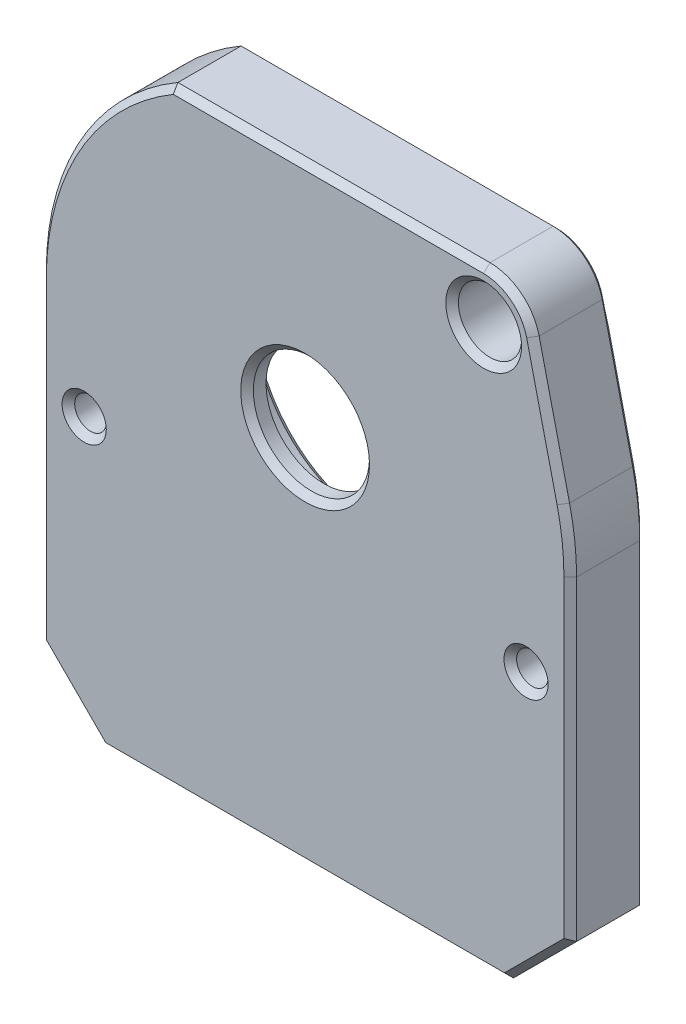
ISO-10303-21;
HEADER;
FILE_DESCRIPTION(('STEP AP214'),'2;1');
FILE_NAME('part.step','',(''),(''),'','','');
FILE_SCHEMA(('AUTOMOTIVE_DESIGN { 1 0 10303 214 1 1 1 1 }'));
ENDSEC;
DATA;
#1=APPLICATION_CONTEXT('core data for automotive mechanical design processes');
#2=APPLICATION_PROTOCOL_DEFINITION('international standard','automotive_design',2000,#1);
#3=PRODUCT_CONTEXT('',#1,'mechanical');
#4=PRODUCT('Part','Part','',(#3));
#5=PRODUCT_RELATED_PRODUCT_CATEGORY('part','',(#4));
#6=PRODUCT_DEFINITION_FORMATION('','',#4);
#7=PRODUCT_DEFINITION_CONTEXT('part definition',#1,'design');
#8=PRODUCT_DEFINITION('design','',#6,#7);
#9=PRODUCT_DEFINITION_SHAPE('','',#8);
#10=(LENGTH_UNIT() NAMED_UNIT(*) SI_UNIT(.MILLI.,.METRE.));
#11=(NAMED_UNIT(*) PLANE_ANGLE_UNIT() SI_UNIT($,.RADIAN.));
#12=(NAMED_UNIT(*) SI_UNIT($,.STERADIAN.) SOLID_ANGLE_UNIT());
#13=UNCERTAINTY_MEASURE_WITH_UNIT(LENGTH_MEASURE(1.E-05),#10,'distance_accuracy_value','');
#14=(GEOMETRIC_REPRESENTATION_CONTEXT(3) GLOBAL_UNCERTAINTY_ASSIGNED_CONTEXT((#13)) GLOBAL_UNIT_ASSIGNED_CONTEXT((#10,
#11,#12)) REPRESENTATION_CONTEXT('',''));
#15=CARTESIAN_POINT('',(0.,0.,0.));
#16=DIRECTION('',(0.,0.,1.));
#17=DIRECTION('',(1.,0.,0.));
#18=AXIS2_PLACEMENT_3D('',#15,#16,#17);
#19=CARTESIAN_POINT('',(14.1421356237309,14.142135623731,6.));
#20=DIRECTION('',(0.,0.,-1.));
#21=DIRECTION('',(-1.,0.,0.));
#22=AXIS2_PLACEMENT_3D('',#19,#20,#21);
#23=CYLINDRICAL_SURFACE('',#22,2.5);
#24=CARTESIAN_POINT('',(14.1421356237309,14.142135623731,5.50000000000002));
#25=DIRECTION('',(0.,0.,1.));
#26=DIRECTION('',(1.,0.,0.));
#27=AXIS2_PLACEMENT_3D('',#24,#25,#26);
#28=CIRCLE('',#27,2.5);
#29=CARTESIAN_POINT('',(16.6421356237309,14.142135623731,5.50000000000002));
#30=VERTEX_POINT('',#29);
#31=EDGE_CURVE('E233',#30,#30,#28,.T.);
#32=ORIENTED_EDGE('',*,*,#31,.T.);
#33=EDGE_LOOP('',(#32));
#34=FACE_BOUND('',#33,.T.);
#35=CARTESIAN_POINT('',(14.1421356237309,14.142135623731,1.50000000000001));
#36=DIRECTION('',(0.,0.,-1.));
#37=DIRECTION('',(-1.,0.,0.));
#38=AXIS2_PLACEMENT_3D('',#35,#36,#37);
#39=CIRCLE('',#38,2.5);
#40=CARTESIAN_POINT('',(11.6421356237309,14.142135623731,1.50000000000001));
#41=VERTEX_POINT('',#40);
#42=EDGE_CURVE('E230',#41,#41,#39,.T.);
#43=ORIENTED_EDGE('',*,*,#42,.T.);
#44=EDGE_LOOP('',(#43));
#45=FACE_BOUND('',#44,.T.);
#46=ADVANCED_FACE('F37',(#34,#45),#23,.F.);
#47=CARTESIAN_POINT('',(0.,0.,6.));
#48=DIRECTION('',(0.,0.,-1.));
#49=DIRECTION('',(-1.,0.,0.));
#50=AXIS2_PLACEMENT_3D('',#47,#48,#49);
#51=CYLINDRICAL_SURFACE('',#50,4.6);
#52=CARTESIAN_POINT('',(0.,0.,5.49999999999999));
#53=DIRECTION('',(0.,0.,1.));
#54=DIRECTION('',(1.,0.,0.));
#55=AXIS2_PLACEMENT_3D('',#52,#53,#54);
#56=CIRCLE('',#55,4.6);
#57=CARTESIAN_POINT('',(4.6,0.,5.49999999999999));
#58=VERTEX_POINT('',#57);
#59=EDGE_CURVE('E47',#58,#58,#56,.T.);
#60=ORIENTED_EDGE('',*,*,#59,.T.);
#61=EDGE_LOOP('',(#60));
#62=FACE_BOUND('',#61,.T.);
#63=CARTESIAN_POINT('',(0.,0.,4.5));
#64=DIRECTION('',(0.,0.,-1.));
#65=DIRECTION('',(-1.,0.,0.));
#66=AXIS2_PLACEMENT_3D('',#63,#64,#65);
#67=CIRCLE('',#66,4.6);
#68=CARTESIAN_POINT('',(-4.6,0.,4.5));
#69=VERTEX_POINT('',#68);
#70=EDGE_CURVE('E462',#69,#69,#67,.T.);
#71=ORIENTED_EDGE('',*,*,#70,.T.);
#72=EDGE_LOOP('',(#71));
#73=FACE_BOUND('',#72,.T.);
#74=ADVANCED_FACE('F613',(#62,#73),#51,.F.);
#75=CARTESIAN_POINT('',(0.,0.,6.));
#76=DIRECTION('',(0.,0.,1.));
#77=DIRECTION('',(1.,0.,0.));
#78=AXIS2_PLACEMENT_3D('',#75,#76,#77);
#79=PLANE('',#78);
#80=CARTESIAN_POINT('',(17.5,-8.,6.));
#81=DIRECTION('',(0.,0.,1.));
#82=DIRECTION('',(1.,0.,0.));
#83=AXIS2_PLACEMENT_3D('',#80,#81,#82);
#84=CIRCLE('',#83,1.75000000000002);
#85=CARTESIAN_POINT('',(19.25,-8.,6.));
#86=VERTEX_POINT('',#85);
#87=EDGE_CURVE('E227',#86,#86,#84,.F.);
#88=ORIENTED_EDGE('',*,*,#87,.T.);
#89=EDGE_LOOP('',(#88));
#90=FACE_BOUND('',#89,.T.);
#91=CARTESIAN_POINT('',(14.1421356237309,14.142135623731,6.));
#92=DIRECTION('',(0.,0.,1.));
#93=DIRECTION('',(1.,0.,0.));
#94=AXIS2_PLACEMENT_3D('',#91,#92,#93);
#95=CIRCLE('',#94,2.99999999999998);
#96=CARTESIAN_POINT('',(17.1421356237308,14.142135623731,6.));
#97=VERTEX_POINT('',#96);
#98=EDGE_CURVE('E224',#97,#97,#95,.F.);
#99=ORIENTED_EDGE('',*,*,#98,.T.);
#100=EDGE_LOOP('',(#99));
#101=FACE_BOUND('',#100,.T.);
#102=CARTESIAN_POINT('',(14.1421356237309,14.142135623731,6.));
#103=DIRECTION('',(0.,0.,1.));
#104=DIRECTION('',(1.,0.,0.));
#105=AXIS2_PLACEMENT_3D('',#102,#103,#104);
#106=CIRCLE('',#105,3.49999999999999);
#107=CARTESIAN_POINT('',(17.5494989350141,14.9420576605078,6.));
#108=VERTEX_POINT('',#107);
#109=CARTESIAN_POINT('',(14.1421356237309,17.642135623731,6.));
#110=VERTEX_POINT('',#109);
#111=EDGE_CURVE('E56',#108,#110,#106,.T.);
#112=ORIENTED_EDGE('',*,*,#111,.T.);
#113=DIRECTION('',(-1.,0.,0.));
#114=VECTOR('',#113,1.);
#115=CARTESIAN_POINT('',(-10.5765266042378,17.642135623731,6.));
#116=LINE('',#115,#114);
#117=CARTESIAN_POINT('',(-10.440548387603,17.642135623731,6.));
#118=VERTEX_POINT('',#117);
#119=EDGE_CURVE('E219',#110,#118,#116,.T.);
#120=ORIENTED_EDGE('',*,*,#119,.T.);
#121=CARTESIAN_POINT('',(0.,0.,6.));
#122=DIRECTION('',(0.,0.,1.));
#123=DIRECTION('',(1.,0.,0.));
#124=AXIS2_PLACEMENT_3D('',#121,#122,#123);
#125=CIRCLE('',#124,20.5);
#126=CARTESIAN_POINT('',(-20.5,0.,6.));
#127=VERTEX_POINT('',#126);
#128=EDGE_CURVE('E414',#118,#127,#125,.T.);
#129=ORIENTED_EDGE('',*,*,#128,.T.);
#130=DIRECTION('',(0.,-1.,0.));
#131=VECTOR('',#130,1.);
#132=CARTESIAN_POINT('',(-20.5,-25.,6.));
#133=LINE('',#132,#131);
#134=CARTESIAN_POINT('',(-20.5,-24.7928932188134,6.));
#135=VERTEX_POINT('',#134);
#136=EDGE_CURVE('E416',#127,#135,#133,.T.);
#137=ORIENTED_EDGE('',*,*,#136,.T.);
#138=DIRECTION('',(0.707106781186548,-0.707106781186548,0.));
#139=VECTOR('',#138,1.);
#140=CARTESIAN_POINT('',(-15.6464466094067,-29.6464466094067,6.));
#141=LINE('',#140,#139);
#142=CARTESIAN_POINT('',(-15.7928932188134,-29.5,6.));
#143=VERTEX_POINT('',#142);
#144=EDGE_CURVE('E418',#135,#143,#141,.T.);
#145=ORIENTED_EDGE('',*,*,#144,.T.);
#146=DIRECTION('',(1.,0.,0.));
#147=VECTOR('',#146,1.);
#148=CARTESIAN_POINT('',(16.,-29.5,6.));
#149=LINE('',#148,#147);
#150=CARTESIAN_POINT('',(15.7928932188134,-29.5,6.));
#151=VERTEX_POINT('',#150);
#152=EDGE_CURVE('E420',#143,#151,#149,.T.);
#153=ORIENTED_EDGE('',*,*,#152,.T.);
#154=DIRECTION('',(0.707106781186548,0.707106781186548,0.));
#155=VECTOR('',#154,1.);
#156=CARTESIAN_POINT('',(20.6464466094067,-24.6464466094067,6.));
#157=LINE('',#156,#155);
#158=CARTESIAN_POINT('',(20.5,-24.7928932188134,6.));
#159=VERTEX_POINT('',#158);
#160=EDGE_CURVE('E365',#151,#159,#157,.T.);
#161=ORIENTED_EDGE('',*,*,#160,.T.);
#162=DIRECTION('',(0.,1.,0.));
#163=VECTOR('',#162,1.);
#164=CARTESIAN_POINT('',(20.5,0.,6.));
#165=LINE('',#164,#163);
#166=CARTESIAN_POINT('',(20.5,0.,6.));
#167=VERTEX_POINT('',#166);
#168=EDGE_CURVE('E200',#159,#167,#165,.T.);
#169=ORIENTED_EDGE('',*,*,#168,.T.);
#170=CARTESIAN_POINT('',(0.,0.,6.));
#171=DIRECTION('',(0.,0.,1.));
#172=DIRECTION('',(1.,0.,0.));
#173=AXIS2_PLACEMENT_3D('',#170,#171,#172);
#174=CIRCLE('',#173,20.5);
#175=CARTESIAN_POINT('',(19.9574136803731,4.68525764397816,6.));
#176=VERTEX_POINT('',#175);
#177=EDGE_CURVE('E192',#167,#176,#174,.T.);
#178=ORIENTED_EDGE('',*,*,#177,.T.);
#179=DIRECTION('',(-0.228549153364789,0.973532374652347,0.));
#180=VECTOR('',#179,1.);
#181=CARTESIAN_POINT('',(17.5494989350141,14.9420576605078,6.));
#182=LINE('',#181,#180);
#183=EDGE_CURVE('E197',#176,#108,#182,.T.);
#184=ORIENTED_EDGE('',*,*,#183,.T.);
#185=EDGE_LOOP('',(#112,#120,#129,#137,#145,#153,#161,#169,#178,#184));
#186=FACE_BOUND('',#185,.T.);
#187=CARTESIAN_POINT('',(0.,0.,6.));
#188=DIRECTION('',(0.,0.,1.));
#189=DIRECTION('',(1.,0.,0.));
#190=AXIS2_PLACEMENT_3D('',#187,#188,#189);
#191=CIRCLE('',#190,5.10000000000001);
#192=CARTESIAN_POINT('',(5.10000000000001,0.,6.));
#193=VERTEX_POINT('',#192);
#194=EDGE_CURVE('E411',#193,#193,#191,.F.);
#195=ORIENTED_EDGE('',*,*,#194,.T.);
#196=EDGE_LOOP('',(#195));
#197=FACE_BOUND('',#196,.T.);
#198=CARTESIAN_POINT('',(-17.5,-8.,6.));
#199=DIRECTION('',(0.,0.,1.));
#200=DIRECTION('',(1.,0.,0.));
#201=AXIS2_PLACEMENT_3D('',#198,#199,#200);
#202=CIRCLE('',#201,1.75000000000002);
#203=CARTESIAN_POINT('',(-15.75,-8.,6.));
#204=VERTEX_POINT('',#203);
#205=EDGE_CURVE('E408',#204,#204,#202,.F.);
#206=ORIENTED_EDGE('',*,*,#205,.T.);
#207=EDGE_LOOP('',(#206));
#208=FACE_BOUND('',#207,.T.);
#209=ADVANCED_FACE('F194',(#90,#101,#186,#197,#208),#79,.T.);
#210=CARTESIAN_POINT('',(0.,0.,0.));
#211=DIRECTION('',(0.,0.,1.));
#212=DIRECTION('',(1.,0.,0.));
#213=AXIS2_PLACEMENT_3D('',#210,#211,#212);
#214=PLANE('',#213);
#215=CARTESIAN_POINT('',(17.5,-8.,0.));
#216=DIRECTION('',(0.,0.,1.));
#217=DIRECTION('',(1.,0.,0.));
#218=AXIS2_PLACEMENT_3D('',#215,#216,#217);
#219=CIRCLE('',#218,1.75000000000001);
#220=CARTESIAN_POINT('',(19.25,-8.,0.));
#221=VERTEX_POINT('',#220);
#222=EDGE_CURVE('E492',#221,#221,#219,.T.);
#223=ORIENTED_EDGE('',*,*,#222,.T.);
#224=EDGE_LOOP('',(#223));
#225=FACE_BOUND('',#224,.T.);
#226=CARTESIAN_POINT('',(-17.5,-8.,0.));
#227=DIRECTION('',(0.,0.,1.));
#228=DIRECTION('',(1.,0.,0.));
#229=AXIS2_PLACEMENT_3D('',#226,#227,#228);
#230=CIRCLE('',#229,1.75000000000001);
#231=CARTESIAN_POINT('',(-15.75,-8.,0.));
#232=VERTEX_POINT('',#231);
#233=EDGE_CURVE('E489',#232,#232,#230,.T.);
#234=ORIENTED_EDGE('',*,*,#233,.T.);
#235=EDGE_LOOP('',(#234));
#236=FACE_BOUND('',#235,.T.);
#237=CARTESIAN_POINT('',(0.,0.,0.));
#238=DIRECTION('',(0.,0.,1.));
#239=DIRECTION('',(1.,0.,0.));
#240=AXIS2_PLACEMENT_3D('',#237,#238,#239);
#241=CIRCLE('',#240,10.);
#242=CARTESIAN_POINT('',(10.,0.,0.));
#243=VERTEX_POINT('',#242);
#244=EDGE_CURVE('E486',#243,#243,#241,.T.);
#245=ORIENTED_EDGE('',*,*,#244,.T.);
#246=EDGE_LOOP('',(#245));
#247=FACE_BOUND('',#246,.T.);
#248=DIRECTION('',(0.,1.,0.));
#249=VECTOR('',#248,1.);
#250=CARTESIAN_POINT('',(-20.5,0.,0.));
#251=LINE('',#250,#249);
#252=CARTESIAN_POINT('',(-20.5,-24.7928932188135,0.));
#253=VERTEX_POINT('',#252);
#254=CARTESIAN_POINT('',(-20.5,0.,0.));
#255=VERTEX_POINT('',#254);
#256=EDGE_CURVE('E481',#253,#255,#251,.T.);
#257=ORIENTED_EDGE('',*,*,#256,.T.);
#258=CARTESIAN_POINT('',(0.,0.,0.));
#259=DIRECTION('',(0.,0.,1.));
#260=DIRECTION('',(1.,0.,0.));
#261=AXIS2_PLACEMENT_3D('',#258,#259,#260);
#262=CIRCLE('',#261,20.5);
#263=CARTESIAN_POINT('',(-10.440548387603,17.642135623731,0.));
#264=VERTEX_POINT('',#263);
#265=EDGE_CURVE('E484',#255,#264,#262,.F.);
#266=ORIENTED_EDGE('',*,*,#265,.T.);
#267=DIRECTION('',(1.,0.,0.));
#268=VECTOR('',#267,1.);
#269=CARTESIAN_POINT('',(0.,17.642135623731,0.));
#270=LINE('',#269,#268);
#271=CARTESIAN_POINT('',(12.2056439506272,17.642135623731,0.));
#272=VERTEX_POINT('',#271);
#273=EDGE_CURVE('E83',#264,#272,#270,.T.);
#274=ORIENTED_EDGE('',*,*,#273,.T.);
#275=CARTESIAN_POINT('',(14.1421356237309,14.142135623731,0.));
#276=DIRECTION('',(0.,0.,1.));
#277=DIRECTION('',(1.,0.,0.));
#278=AXIS2_PLACEMENT_3D('',#275,#276,#277);
#279=CIRCLE('',#278,4.);
#280=CARTESIAN_POINT('',(17.9920824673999,13.0568203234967,0.));
#281=VERTEX_POINT('',#280);
#282=EDGE_CURVE('E461',#272,#281,#279,.T.);
#283=ORIENTED_EDGE('',*,*,#282,.T.);
#284=DIRECTION('',(0.228549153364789,-0.973532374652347,0.));
#285=VECTOR('',#284,1.);
#286=CARTESIAN_POINT('',(19.9574136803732,4.68525764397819,0.));
#287=LINE('',#286,#285);
#288=CARTESIAN_POINT('',(19.9574136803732,4.68525764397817,0.));
#289=VERTEX_POINT('',#288);
#290=EDGE_CURVE('E469',#281,#289,#287,.T.);
#291=ORIENTED_EDGE('',*,*,#290,.T.);
#292=CARTESIAN_POINT('',(0.,0.,0.));
#293=DIRECTION('',(0.,0.,1.));
#294=DIRECTION('',(1.,0.,0.));
#295=AXIS2_PLACEMENT_3D('',#292,#293,#294);
#296=CIRCLE('',#295,20.5);
#297=CARTESIAN_POINT('',(20.5,0.,0.));
#298=VERTEX_POINT('',#297);
#299=EDGE_CURVE('E471',#289,#298,#296,.F.);
#300=ORIENTED_EDGE('',*,*,#299,.T.);
#301=DIRECTION('',(0.,-1.,0.));
#302=VECTOR('',#301,1.);
#303=CARTESIAN_POINT('',(20.5,0.,0.));
#304=LINE('',#303,#302);
#305=CARTESIAN_POINT('',(20.5,-24.7928932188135,0.));
#306=VERTEX_POINT('',#305);
#307=EDGE_CURVE('E473',#298,#306,#304,.T.);
#308=ORIENTED_EDGE('',*,*,#307,.T.);
#309=DIRECTION('',(-0.707106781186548,-0.707106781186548,0.));
#310=VECTOR('',#309,1.);
#311=CARTESIAN_POINT('',(22.6464466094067,-22.6464466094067,0.));
#312=LINE('',#311,#310);
#313=CARTESIAN_POINT('',(15.7928932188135,-29.5,0.));
#314=VERTEX_POINT('',#313);
#315=EDGE_CURVE('E475',#306,#314,#312,.T.);
#316=ORIENTED_EDGE('',*,*,#315,.T.);
#317=DIRECTION('',(-1.,0.,0.));
#318=VECTOR('',#317,1.);
#319=CARTESIAN_POINT('',(0.,-29.5,0.));
#320=LINE('',#319,#318);
#321=CARTESIAN_POINT('',(-15.7928932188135,-29.5,0.));
#322=VERTEX_POINT('',#321);
#323=EDGE_CURVE('E477',#314,#322,#320,.T.);
#324=ORIENTED_EDGE('',*,*,#323,.T.);
#325=DIRECTION('',(-0.707106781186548,0.707106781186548,0.));
#326=VECTOR('',#325,1.);
#327=CARTESIAN_POINT('',(-22.6464466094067,-22.6464466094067,0.));
#328=LINE('',#327,#326);
#329=EDGE_CURVE('E479',#322,#253,#328,.T.);
#330=ORIENTED_EDGE('',*,*,#329,.T.);
#331=EDGE_LOOP('',(#257,#266,#274,#283,#291,#300,#308,#316,#324,#330));
#332=FACE_BOUND('',#331,.T.);
#333=ADVANCED_FACE('F563',(#225,#236,#247,#332),#214,.F.);
#334=CARTESIAN_POINT('',(0.,0.,6.));
#335=DIRECTION('',(0.,0.,-1.));
#336=DIRECTION('',(-1.,0.,0.));
#337=AXIS2_PLACEMENT_3D('',#334,#335,#336);
#338=CYLINDRICAL_SURFACE('',#337,21.);
#339=DIRECTION('',(0.,0.,-1.));
#340=VECTOR('',#339,1.);
#341=CARTESIAN_POINT('',(-10.5765266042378,18.142135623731,6.));
#342=LINE('',#341,#340);
#343=CARTESIAN_POINT('',(-10.5765266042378,18.142135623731,5.49999999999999));
#344=VERTEX_POINT('',#343);
#345=CARTESIAN_POINT('',(-10.5765266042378,18.142135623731,0.49999999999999));
#346=VERTEX_POINT('',#345);
#347=EDGE_CURVE('E531',#344,#346,#342,.T.);
#348=ORIENTED_EDGE('',*,*,#347,.T.);
#349=CARTESIAN_POINT('',(0.,0.,0.49999999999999));
#350=DIRECTION('',(0.,0.,1.));
#351=DIRECTION('',(1.,0.,0.));
#352=AXIS2_PLACEMENT_3D('',#349,#350,#351);
#353=CIRCLE('',#352,21.);
#354=CARTESIAN_POINT('',(-21.,0.,0.49999999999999));
#355=VERTEX_POINT('',#354);
#356=EDGE_CURVE('E400',#346,#355,#353,.T.);
#357=ORIENTED_EDGE('',*,*,#356,.T.);
#358=DIRECTION('',(0.,0.,-1.));
#359=VECTOR('',#358,1.);
#360=CARTESIAN_POINT('',(-21.,0.,6.));
#361=LINE('',#360,#359);
#362=CARTESIAN_POINT('',(-21.,0.,5.49999999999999));
#363=VERTEX_POINT('',#362);
#364=EDGE_CURVE('E453',#363,#355,#361,.T.);
#365=ORIENTED_EDGE('',*,*,#364,.F.);
#366=CARTESIAN_POINT('',(0.,0.,5.49999999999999));
#367=DIRECTION('',(0.,0.,1.));
#368=DIRECTION('',(1.,0.,0.));
#369=AXIS2_PLACEMENT_3D('',#366,#367,#368);
#370=CIRCLE('',#369,21.);
#371=EDGE_CURVE('E398',#363,#344,#370,.F.);
#372=ORIENTED_EDGE('',*,*,#371,.T.);
#373=EDGE_LOOP('',(#348,#357,#365,#372));
#374=FACE_BOUND('',#373,.T.);
#375=ADVANCED_FACE('F514',(#374),#338,.T.);
#376=CARTESIAN_POINT('',(-21.,0.,6.));
#377=DIRECTION('',(1.,0.,0.));
#378=DIRECTION('',(0.,0.,-1.));
#379=AXIS2_PLACEMENT_3D('',#376,#377,#378);
#380=PLANE('',#379);
#381=ORIENTED_EDGE('',*,*,#364,.T.);
#382=DIRECTION('',(0.,-1.,0.));
#383=VECTOR('',#382,1.);
#384=CARTESIAN_POINT('',(-21.,0.,0.49999999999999));
#385=LINE('',#384,#383);
#386=CARTESIAN_POINT('',(-21.,-25.,0.49999999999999));
#387=VERTEX_POINT('',#386);
#388=EDGE_CURVE('E436',#355,#387,#385,.T.);
#389=ORIENTED_EDGE('',*,*,#388,.T.);
#390=DIRECTION('',(0.,0.,-1.));
#391=VECTOR('',#390,1.);
#392=CARTESIAN_POINT('',(-21.,-25.,6.));
#393=LINE('',#392,#391);
#394=CARTESIAN_POINT('',(-21.,-25.,5.49999999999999));
#395=VERTEX_POINT('',#394);
#396=EDGE_CURVE('E451',#395,#387,#393,.T.);
#397=ORIENTED_EDGE('',*,*,#396,.F.);
#398=DIRECTION('',(0.,1.,0.));
#399=VECTOR('',#398,1.);
#400=CARTESIAN_POINT('',(-21.,0.,5.49999999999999));
#401=LINE('',#400,#399);
#402=EDGE_CURVE('E440',#395,#363,#401,.T.);
#403=ORIENTED_EDGE('',*,*,#402,.T.);
#404=EDGE_LOOP('',(#381,#389,#397,#403));
#405=FACE_BOUND('',#404,.T.);
#406=ADVANCED_FACE('F508',(#405),#380,.F.);
#407=CARTESIAN_POINT('',(-21.,-25.,6.));
#408=DIRECTION('',(0.707106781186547,0.707106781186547,0.));
#409=DIRECTION('',(-0.707106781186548,0.707106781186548,0.));
#410=AXIS2_PLACEMENT_3D('',#407,#408,#409);
#411=PLANE('',#410);
#412=ORIENTED_EDGE('',*,*,#396,.T.);
#413=DIRECTION('',(0.707106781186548,-0.707106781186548,0.));
#414=VECTOR('',#413,1.);
#415=CARTESIAN_POINT('',(-21.,-25.,0.49999999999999));
#416=LINE('',#415,#414);
#417=CARTESIAN_POINT('',(-16.,-30.,0.49999999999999));
#418=VERTEX_POINT('',#417);
#419=EDGE_CURVE('E435',#387,#418,#416,.T.);
#420=ORIENTED_EDGE('',*,*,#419,.T.);
#421=DIRECTION('',(0.,0.,-1.));
#422=VECTOR('',#421,1.);
#423=CARTESIAN_POINT('',(-16.,-30.,6.));
#424=LINE('',#423,#422);
#425=CARTESIAN_POINT('',(-16.,-30.,5.49999999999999));
#426=VERTEX_POINT('',#425);
#427=EDGE_CURVE('E446',#426,#418,#424,.T.);
#428=ORIENTED_EDGE('',*,*,#427,.F.);
#429=DIRECTION('',(-0.707106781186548,0.707106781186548,0.));
#430=VECTOR('',#429,1.);
#431=CARTESIAN_POINT('',(-21.,-25.,5.49999999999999));
#432=LINE('',#431,#430);
#433=EDGE_CURVE('E429',#426,#395,#432,.T.);
#434=ORIENTED_EDGE('',*,*,#433,.T.);
#435=EDGE_LOOP('',(#412,#420,#428,#434));
#436=FACE_BOUND('',#435,.T.);
#437=ADVANCED_FACE('F449',(#436),#411,.F.);
#438=CARTESIAN_POINT('',(-16.,-30.,6.));
#439=DIRECTION('',(0.,1.,0.));
#440=DIRECTION('',(0.,0.,1.));
#441=AXIS2_PLACEMENT_3D('',#438,#439,#440);
#442=PLANE('',#441);
#443=CARTESIAN_POINT('',(-10.,-30.,3.));
#444=DIRECTION('',(0.,-1.,0.));
#445=DIRECTION('',(0.,0.,-1.));
#446=AXIS2_PLACEMENT_3D('',#443,#444,#445);
#447=CIRCLE('',#446,1.25);
#448=CARTESIAN_POINT('',(-10.,-30.,1.75));
#449=VERTEX_POINT('',#448);
#450=EDGE_CURVE('E584',#449,#449,#447,.T.);
#451=ORIENTED_EDGE('',*,*,#450,.F.);
#452=EDGE_LOOP('',(#451));
#453=FACE_BOUND('',#452,.T.);
#454=CARTESIAN_POINT('',(10.,-30.,3.));
#455=DIRECTION('',(0.,-1.,0.));
#456=DIRECTION('',(0.,0.,1.));
#457=AXIS2_PLACEMENT_3D('',#454,#455,#456);
#458=CIRCLE('',#457,1.25);
#459=CARTESIAN_POINT('',(10.,-30.,4.25));
#460=VERTEX_POINT('',#459);
#461=EDGE_CURVE('E572',#460,#460,#458,.T.);
#462=ORIENTED_EDGE('',*,*,#461,.F.);
#463=EDGE_LOOP('',(#462));
#464=FACE_BOUND('',#463,.T.);
#465=ORIENTED_EDGE('',*,*,#427,.T.);
#466=DIRECTION('',(1.,0.,0.));
#467=VECTOR('',#466,1.);
#468=CARTESIAN_POINT('',(-16.,-30.,0.49999999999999));
#469=LINE('',#468,#467);
#470=CARTESIAN_POINT('',(16.,-30.,0.49999999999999));
#471=VERTEX_POINT('',#470);
#472=EDGE_CURVE('E372',#418,#471,#469,.T.);
#473=ORIENTED_EDGE('',*,*,#472,.T.);
#474=DIRECTION('',(0.,0.,-1.));
#475=VECTOR('',#474,1.);
#476=CARTESIAN_POINT('',(16.,-30.,6.));
#477=LINE('',#476,#475);
#478=CARTESIAN_POINT('',(16.,-30.,5.49999999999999));
#479=VERTEX_POINT('',#478);
#480=EDGE_CURVE('E448',#479,#471,#477,.T.);
#481=ORIENTED_EDGE('',*,*,#480,.F.);
#482=DIRECTION('',(-1.,0.,0.));
#483=VECTOR('',#482,1.);
#484=CARTESIAN_POINT('',(-16.,-30.,5.49999999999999));
#485=LINE('',#484,#483);
#486=EDGE_CURVE('E375',#479,#426,#485,.T.);
#487=ORIENTED_EDGE('',*,*,#486,.T.);
#488=EDGE_LOOP('',(#465,#473,#481,#487));
#489=FACE_BOUND('',#488,.T.);
#490=ADVANCED_FACE('F445',(#453,#464,#489),#442,.F.);
#491=CARTESIAN_POINT('',(16.,-30.,6.));
#492=DIRECTION('',(-0.707106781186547,0.707106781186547,0.));
#493=DIRECTION('',(-0.707106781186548,-0.707106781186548,0.));
#494=AXIS2_PLACEMENT_3D('',#491,#492,#493);
#495=PLANE('',#494);
#496=ORIENTED_EDGE('',*,*,#480,.T.);
#497=DIRECTION('',(0.707106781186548,0.707106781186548,0.));
#498=VECTOR('',#497,1.);
#499=CARTESIAN_POINT('',(16.,-30.,0.49999999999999));
#500=LINE('',#499,#498);
#501=CARTESIAN_POINT('',(21.,-25.,0.49999999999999));
#502=VERTEX_POINT('',#501);
#503=EDGE_CURVE('E371',#471,#502,#500,.T.);
#504=ORIENTED_EDGE('',*,*,#503,.T.);
#505=DIRECTION('',(0.,0.,-1.));
#506=VECTOR('',#505,1.);
#507=CARTESIAN_POINT('',(21.,-25.,6.));
#508=LINE('',#507,#506);
#509=CARTESIAN_POINT('',(21.,-25.,5.49999999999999));
#510=VERTEX_POINT('',#509);
#511=EDGE_CURVE('E455',#510,#502,#508,.T.);
#512=ORIENTED_EDGE('',*,*,#511,.F.);
#513=DIRECTION('',(-0.707106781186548,-0.707106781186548,0.));
#514=VECTOR('',#513,1.);
#515=CARTESIAN_POINT('',(16.,-30.,5.49999999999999));
#516=LINE('',#515,#514);
#517=EDGE_CURVE('E366',#510,#479,#516,.T.);
#518=ORIENTED_EDGE('',*,*,#517,.T.);
#519=EDGE_LOOP('',(#496,#504,#512,#518));
#520=FACE_BOUND('',#519,.T.);
#521=ADVANCED_FACE('F644',(#520),#495,.F.);
#522=CARTESIAN_POINT('',(21.,-25.,6.));
#523=DIRECTION('',(-1.,0.,0.));
#524=DIRECTION('',(0.,0.,1.));
#525=AXIS2_PLACEMENT_3D('',#522,#523,#524);
#526=PLANE('',#525);
#527=ORIENTED_EDGE('',*,*,#511,.T.);
#528=DIRECTION('',(0.,1.,0.));
#529=VECTOR('',#528,1.);
#530=CARTESIAN_POINT('',(21.,-25.,0.49999999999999));
#531=LINE('',#530,#529);
#532=CARTESIAN_POINT('',(21.,0.,0.49999999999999));
#533=VERTEX_POINT('',#532);
#534=EDGE_CURVE('E380',#502,#533,#531,.T.);
#535=ORIENTED_EDGE('',*,*,#534,.T.);
#536=DIRECTION('',(0.,0.,-1.));
#537=VECTOR('',#536,1.);
#538=CARTESIAN_POINT('',(21.,0.,6.));
#539=LINE('',#538,#537);
#540=CARTESIAN_POINT('',(21.,0.,5.49999999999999));
#541=VERTEX_POINT('',#540);
#542=EDGE_CURVE('E546',#541,#533,#539,.T.);
#543=ORIENTED_EDGE('',*,*,#542,.F.);
#544=DIRECTION('',(0.,-1.,0.));
#545=VECTOR('',#544,1.);
#546=CARTESIAN_POINT('',(21.,-25.,5.49999999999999));
#547=LINE('',#546,#545);
#548=EDGE_CURVE('E361',#541,#510,#547,.T.);
#549=ORIENTED_EDGE('',*,*,#548,.T.);
#550=EDGE_LOOP('',(#527,#535,#543,#549));
#551=FACE_BOUND('',#550,.T.);
#552=ADVANCED_FACE('F551',(#551),#526,.F.);
#553=CARTESIAN_POINT('',(0.,0.,6.));
#554=DIRECTION('',(0.,0.,-1.));
#555=DIRECTION('',(-1.,0.,0.));
#556=AXIS2_PLACEMENT_3D('',#553,#554,#555);
#557=CYLINDRICAL_SURFACE('',#556,21.);
#558=ORIENTED_EDGE('',*,*,#542,.T.);
#559=CARTESIAN_POINT('',(0.,0.,0.49999999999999));
#560=DIRECTION('',(0.,0.,1.));
#561=DIRECTION('',(1.,0.,0.));
#562=AXIS2_PLACEMENT_3D('',#559,#560,#561);
#563=CIRCLE('',#562,21.);
#564=CARTESIAN_POINT('',(20.4441798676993,4.79953222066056,0.49999999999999));
#565=VERTEX_POINT('',#564);
#566=EDGE_CURVE('E383',#533,#565,#563,.T.);
#567=ORIENTED_EDGE('',*,*,#566,.T.);
#568=DIRECTION('',(0.,0.,-1.));
#569=VECTOR('',#568,1.);
#570=CARTESIAN_POINT('',(20.4441798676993,4.79953222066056,6.));
#571=LINE('',#570,#569);
#572=CARTESIAN_POINT('',(20.4441798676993,4.79953222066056,5.49999999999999));
#573=VERTEX_POINT('',#572);
#574=EDGE_CURVE('E539',#573,#565,#571,.T.);
#575=ORIENTED_EDGE('',*,*,#574,.F.);
#576=CARTESIAN_POINT('',(0.,0.,5.49999999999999));
#577=DIRECTION('',(0.,0.,1.));
#578=DIRECTION('',(1.,0.,0.));
#579=AXIS2_PLACEMENT_3D('',#576,#577,#578);
#580=CIRCLE('',#579,21.);
#581=EDGE_CURVE('E209',#573,#541,#580,.F.);
#582=ORIENTED_EDGE('',*,*,#581,.T.);
#583=EDGE_LOOP('',(#558,#567,#575,#582));
#584=FACE_BOUND('',#583,.T.);
#585=ADVANCED_FACE('F637',(#584),#557,.T.);
#586=CARTESIAN_POINT('',(18.0362651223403,15.0563322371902,6.));
#587=DIRECTION('',(-0.973532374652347,-0.228549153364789,0.));
#588=DIRECTION('',(0.228549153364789,-0.973532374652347,0.));
#589=AXIS2_PLACEMENT_3D('',#586,#587,#588);
#590=PLANE('',#589);
#591=ORIENTED_EDGE('',*,*,#574,.T.);
#592=DIRECTION('',(-0.228549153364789,0.973532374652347,0.));
#593=VECTOR('',#592,1.);
#594=CARTESIAN_POINT('',(18.0362651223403,15.0563322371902,0.49999999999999));
#595=LINE('',#594,#593);
#596=CARTESIAN_POINT('',(18.0362651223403,15.0563322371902,0.49999999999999));
#597=VERTEX_POINT('',#596);
#598=EDGE_CURVE('E387',#565,#597,#595,.T.);
#599=ORIENTED_EDGE('',*,*,#598,.T.);
#600=DIRECTION('',(0.,0.,-1.));
#601=VECTOR('',#600,1.);
#602=CARTESIAN_POINT('',(18.0362651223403,15.0563322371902,6.));
#603=LINE('',#602,#601);
#604=CARTESIAN_POINT('',(18.0362651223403,15.0563322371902,5.49999999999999));
#605=VERTEX_POINT('',#604);
#606=EDGE_CURVE('E537',#605,#597,#603,.T.);
#607=ORIENTED_EDGE('',*,*,#606,.F.);
#608=DIRECTION('',(0.228549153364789,-0.973532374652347,0.));
#609=VECTOR('',#608,1.);
#610=CARTESIAN_POINT('',(20.4441798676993,4.79953222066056,5.49999999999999));
#611=LINE('',#610,#609);
#612=EDGE_CURVE('E385',#605,#573,#611,.T.);
#613=ORIENTED_EDGE('',*,*,#612,.T.);
#614=EDGE_LOOP('',(#591,#599,#607,#613));
#615=FACE_BOUND('',#614,.T.);
#616=ADVANCED_FACE('F634',(#615),#590,.F.);
#617=CARTESIAN_POINT('',(14.1421356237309,14.142135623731,6.));
#618=DIRECTION('',(0.,0.,-1.));
#619=DIRECTION('',(-1.,0.,0.));
#620=AXIS2_PLACEMENT_3D('',#617,#618,#619);
#621=CYLINDRICAL_SURFACE('',#620,4.);
#622=ORIENTED_EDGE('',*,*,#606,.T.);
#623=CARTESIAN_POINT('',(14.1421356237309,14.142135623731,0.49999999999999));
#624=DIRECTION('',(0.,0.,1.));
#625=DIRECTION('',(1.,0.,0.));
#626=AXIS2_PLACEMENT_3D('',#623,#624,#625);
#627=CIRCLE('',#626,4.);
#628=CARTESIAN_POINT('',(14.1421356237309,18.142135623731,0.49999999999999));
#629=VERTEX_POINT('',#628);
#630=EDGE_CURVE('E391',#597,#629,#627,.T.);
#631=ORIENTED_EDGE('',*,*,#630,.T.);
#632=DIRECTION('',(0.,0.,-1.));
#633=VECTOR('',#632,1.);
#634=CARTESIAN_POINT('',(14.1421356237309,18.142135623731,6.));
#635=LINE('',#634,#633);
#636=CARTESIAN_POINT('',(14.1421356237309,18.142135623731,5.49999999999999));
#637=VERTEX_POINT('',#636);
#638=EDGE_CURVE('E530',#637,#629,#635,.T.);
#639=ORIENTED_EDGE('',*,*,#638,.F.);
#640=CARTESIAN_POINT('',(14.1421356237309,14.142135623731,5.49999999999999));
#641=DIRECTION('',(0.,0.,1.));
#642=DIRECTION('',(1.,0.,0.));
#643=AXIS2_PLACEMENT_3D('',#640,#641,#642);
#644=CIRCLE('',#643,4.);
#645=EDGE_CURVE('E389',#637,#605,#644,.F.);
#646=ORIENTED_EDGE('',*,*,#645,.T.);
#647=EDGE_LOOP('',(#622,#631,#639,#646));
#648=FACE_BOUND('',#647,.T.);
#649=ADVANCED_FACE('F534',(#648),#621,.T.);
#650=CARTESIAN_POINT('',(-10.5765266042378,18.142135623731,6.));
#651=DIRECTION('',(0.,-1.,0.));
#652=DIRECTION('',(0.,0.,-1.));
#653=AXIS2_PLACEMENT_3D('',#650,#651,#652);
#654=PLANE('',#653);
#655=ORIENTED_EDGE('',*,*,#638,.T.);
#656=DIRECTION('',(-1.,0.,0.));
#657=VECTOR('',#656,1.);
#658=CARTESIAN_POINT('',(-10.5765266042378,18.142135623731,0.49999999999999));
#659=LINE('',#658,#657);
#660=EDGE_CURVE('E396',#629,#346,#659,.T.);
#661=ORIENTED_EDGE('',*,*,#660,.T.);
#662=ORIENTED_EDGE('',*,*,#347,.F.);
#663=DIRECTION('',(1.,0.,0.));
#664=VECTOR('',#663,1.);
#665=CARTESIAN_POINT('',(14.1421356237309,18.142135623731,5.49999999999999));
#666=LINE('',#665,#664);
#667=EDGE_CURVE('E393',#344,#637,#666,.T.);
#668=ORIENTED_EDGE('',*,*,#667,.T.);
#669=EDGE_LOOP('',(#655,#661,#662,#668));
#670=FACE_BOUND('',#669,.T.);
#671=ADVANCED_FACE('F529',(#670),#654,.F.);
#672=CARTESIAN_POINT('',(-17.5,-8.,6.));
#673=DIRECTION('',(0.,0.,-1.));
#674=DIRECTION('',(-1.,0.,0.));
#675=AXIS2_PLACEMENT_3D('',#672,#673,#674);
#676=CYLINDRICAL_SURFACE('',#675,1.25);
#677=CARTESIAN_POINT('',(-17.5,-8.,0.500000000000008));
#678=DIRECTION('',(0.,0.,1.));
#679=DIRECTION('',(1.,0.,0.));
#680=AXIS2_PLACEMENT_3D('',#677,#678,#679);
#681=CIRCLE('',#680,1.25);
#682=CARTESIAN_POINT('',(-16.25,-8.,0.500000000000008));
#683=VERTEX_POINT('',#682);
#684=EDGE_CURVE('E504',#683,#683,#681,.F.);
#685=ORIENTED_EDGE('',*,*,#684,.T.);
#686=EDGE_LOOP('',(#685));
#687=FACE_BOUND('',#686,.T.);
#688=CARTESIAN_POINT('',(-17.5,-8.,5.49999999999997));
#689=DIRECTION('',(0.,0.,1.));
#690=DIRECTION('',(1.,0.,0.));
#691=AXIS2_PLACEMENT_3D('',#688,#689,#690);
#692=CIRCLE('',#691,1.25);
#693=CARTESIAN_POINT('',(-16.25,-8.,5.49999999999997));
#694=VERTEX_POINT('',#693);
#695=EDGE_CURVE('E501',#694,#694,#692,.T.);
#696=ORIENTED_EDGE('',*,*,#695,.T.);
#697=EDGE_LOOP('',(#696));
#698=FACE_BOUND('',#697,.T.);
#699=ADVANCED_FACE('F609',(#687,#698),#676,.F.);
#700=CARTESIAN_POINT('',(17.5,-8.,6.));
#701=DIRECTION('',(0.,0.,-1.));
#702=DIRECTION('',(-1.,0.,0.));
#703=AXIS2_PLACEMENT_3D('',#700,#701,#702);
#704=CYLINDRICAL_SURFACE('',#703,1.25);
#705=CARTESIAN_POINT('',(17.5,-8.,0.500000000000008));
#706=DIRECTION('',(0.,0.,1.));
#707=DIRECTION('',(1.,0.,0.));
#708=AXIS2_PLACEMENT_3D('',#705,#706,#707);
#709=CIRCLE('',#708,1.25);
#710=CARTESIAN_POINT('',(18.75,-8.,0.500000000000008));
#711=VERTEX_POINT('',#710);
#712=EDGE_CURVE('E498',#711,#711,#709,.F.);
#713=ORIENTED_EDGE('',*,*,#712,.T.);
#714=EDGE_LOOP('',(#713));
#715=FACE_BOUND('',#714,.T.);
#716=CARTESIAN_POINT('',(17.5,-8.,5.49999999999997));
#717=DIRECTION('',(0.,0.,1.));
#718=DIRECTION('',(1.,0.,0.));
#719=AXIS2_PLACEMENT_3D('',#716,#717,#718);
#720=CIRCLE('',#719,1.25);
#721=CARTESIAN_POINT('',(18.75,-8.,5.49999999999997));
#722=VERTEX_POINT('',#721);
#723=EDGE_CURVE('E495',#722,#722,#720,.T.);
#724=ORIENTED_EDGE('',*,*,#723,.T.);
#725=EDGE_LOOP('',(#724));
#726=FACE_BOUND('',#725,.T.);
#727=ADVANCED_FACE('F599',(#715,#726),#704,.F.);
#728=CARTESIAN_POINT('',(0.,0.,4.));
#729=DIRECTION('',(0.,0.,-1.));
#730=DIRECTION('',(-1.,0.,0.));
#731=AXIS2_PLACEMENT_3D('',#728,#729,#730);
#732=CYLINDRICAL_SURFACE('',#731,9.5);
#733=CARTESIAN_POINT('',(0.,0.,0.5));
#734=DIRECTION('',(0.,0.,1.));
#735=DIRECTION('',(1.,0.,0.));
#736=AXIS2_PLACEMENT_3D('',#733,#734,#735);
#737=CIRCLE('',#736,9.5);
#738=CARTESIAN_POINT('',(9.5,0.,0.5));
#739=VERTEX_POINT('',#738);
#740=EDGE_CURVE('E402',#739,#739,#737,.F.);
#741=ORIENTED_EDGE('',*,*,#740,.T.);
#742=EDGE_LOOP('',(#741));
#743=FACE_BOUND('',#742,.T.);
#744=CARTESIAN_POINT('',(0.,0.,4.));
#745=DIRECTION('',(0.,0.,-1.));
#746=DIRECTION('',(-1.,0.,0.));
#747=AXIS2_PLACEMENT_3D('',#744,#745,#746);
#748=CIRCLE('',#747,9.5);
#749=CARTESIAN_POINT('',(-9.5,0.,4.));
#750=VERTEX_POINT('',#749);
#751=EDGE_CURVE('E465',#750,#750,#748,.T.);
#752=ORIENTED_EDGE('',*,*,#751,.F.);
#753=EDGE_LOOP('',(#752));
#754=FACE_BOUND('',#753,.T.);
#755=ADVANCED_FACE('F597',(#743,#754),#732,.F.);
#756=CARTESIAN_POINT('',(0.,0.,4.));
#757=DIRECTION('',(0.,0.,-1.));
#758=DIRECTION('',(-1.,0.,0.));
#759=AXIS2_PLACEMENT_3D('',#756,#757,#758);
#760=PLANE('',#759);
#761=CARTESIAN_POINT('',(0.,0.,4.));
#762=DIRECTION('',(0.,0.,-1.));
#763=DIRECTION('',(-1.,0.,0.));
#764=AXIS2_PLACEMENT_3D('',#761,#762,#763);
#765=CIRCLE('',#764,8.);
#766=CARTESIAN_POINT('',(-8.,0.,4.));
#767=VERTEX_POINT('',#766);
#768=EDGE_CURVE('E583',#767,#767,#765,.T.);
#769=ORIENTED_EDGE('',*,*,#768,.F.);
#770=EDGE_LOOP('',(#769));
#771=FACE_BOUND('',#770,.T.);
#772=ORIENTED_EDGE('',*,*,#751,.T.);
#773=EDGE_LOOP('',(#772));
#774=FACE_BOUND('',#773,.T.);
#775=ADVANCED_FACE('F595',(#771,#774),#760,.T.);
#776=CARTESIAN_POINT('',(0.,0.,4.5));
#777=DIRECTION('',(0.,0.,-1.));
#778=DIRECTION('',(-1.,0.,0.));
#779=AXIS2_PLACEMENT_3D('',#776,#777,#778);
#780=CYLINDRICAL_SURFACE('',#779,8.);
#781=CARTESIAN_POINT('',(0.,0.,4.5));
#782=DIRECTION('',(0.,0.,-1.));
#783=DIRECTION('',(-1.,0.,0.));
#784=AXIS2_PLACEMENT_3D('',#781,#782,#783);
#785=CIRCLE('',#784,8.);
#786=CARTESIAN_POINT('',(-8.,0.,4.5));
#787=VERTEX_POINT('',#786);
#788=EDGE_CURVE('E466',#787,#787,#785,.T.);
#789=ORIENTED_EDGE('',*,*,#788,.F.);
#790=EDGE_LOOP('',(#789));
#791=FACE_BOUND('',#790,.T.);
#792=ORIENTED_EDGE('',*,*,#768,.T.);
#793=EDGE_LOOP('',(#792));
#794=FACE_BOUND('',#793,.T.);
#795=ADVANCED_FACE('F606',(#791,#794),#780,.F.);
#796=CARTESIAN_POINT('',(0.,0.,4.5));
#797=DIRECTION('',(0.,0.,-1.));
#798=DIRECTION('',(-1.,0.,0.));
#799=AXIS2_PLACEMENT_3D('',#796,#797,#798);
#800=PLANE('',#799);
#801=ORIENTED_EDGE('',*,*,#70,.F.);
#802=EDGE_LOOP('',(#801));
#803=FACE_BOUND('',#802,.T.);
#804=ORIENTED_EDGE('',*,*,#788,.T.);
#805=EDGE_LOOP('',(#804));
#806=FACE_BOUND('',#805,.T.);
#807=ADVANCED_FACE('F953',(#803,#806),#800,.T.);
#808=CARTESIAN_POINT('',(10.,-22.,3.));
#809=DIRECTION('',(0.,-1.,0.));
#810=DIRECTION('',(0.,0.,-1.));
#811=AXIS2_PLACEMENT_3D('',#808,#809,#810);
#812=CYLINDRICAL_SURFACE('',#811,1.25);
#813=CARTESIAN_POINT('',(10.,-22.,3.));
#814=DIRECTION('',(0.,-1.,0.));
#815=DIRECTION('',(0.,0.,1.));
#816=AXIS2_PLACEMENT_3D('',#813,#814,#815);
#817=CIRCLE('',#816,1.25);
#818=CARTESIAN_POINT('',(10.,-22.,4.25));
#819=VERTEX_POINT('',#818);
#820=EDGE_CURVE('E577',#819,#819,#817,.T.);
#821=ORIENTED_EDGE('',*,*,#820,.F.);
#822=EDGE_LOOP('',(#821));
#823=FACE_BOUND('',#822,.T.);
#824=ORIENTED_EDGE('',*,*,#461,.T.);
#825=EDGE_LOOP('',(#824));
#826=FACE_BOUND('',#825,.T.);
#827=ADVANCED_FACE('F949',(#823,#826),#812,.F.);
#828=CARTESIAN_POINT('',(10.,-22.,3.));
#829=DIRECTION('',(0.,1.,0.));
#830=DIRECTION('',(0.,0.,1.));
#831=AXIS2_PLACEMENT_3D('',#828,#829,#830);
#832=PLANE('',#831);
#833=ORIENTED_EDGE('',*,*,#820,.T.);
#834=EDGE_LOOP('',(#833));
#835=FACE_BOUND('',#834,.T.);
#836=ADVANCED_FACE('F945',(#835),#832,.F.);
#837=CARTESIAN_POINT('',(-10.,-22.,3.));
#838=DIRECTION('',(0.,-1.,0.));
#839=DIRECTION('',(0.,0.,-1.));
#840=AXIS2_PLACEMENT_3D('',#837,#838,#839);
#841=CYLINDRICAL_SURFACE('',#840,1.25);
#842=CARTESIAN_POINT('',(-10.,-22.,3.));
#843=DIRECTION('',(0.,-1.,0.));
#844=DIRECTION('',(0.,0.,-1.));
#845=AXIS2_PLACEMENT_3D('',#842,#843,#844);
#846=CIRCLE('',#845,1.25);
#847=CARTESIAN_POINT('',(-10.,-22.,1.75));
#848=VERTEX_POINT('',#847);
#849=EDGE_CURVE('E580',#848,#848,#846,.T.);
#850=ORIENTED_EDGE('',*,*,#849,.F.);
#851=EDGE_LOOP('',(#850));
#852=FACE_BOUND('',#851,.T.);
#853=ORIENTED_EDGE('',*,*,#450,.T.);
#854=EDGE_LOOP('',(#853));
#855=FACE_BOUND('',#854,.T.);
#856=ADVANCED_FACE('F941',(#852,#855),#841,.F.);
#857=CARTESIAN_POINT('',(-10.,-22.,3.));
#858=DIRECTION('',(0.,-1.,0.));
#859=DIRECTION('',(0.,0.,-1.));
#860=AXIS2_PLACEMENT_3D('',#857,#858,#859);
#861=PLANE('',#860);
#862=ORIENTED_EDGE('',*,*,#849,.T.);
#863=EDGE_LOOP('',(#862));
#864=FACE_BOUND('',#863,.T.);
#865=ADVANCED_FACE('F746',(#864),#861,.T.);
#866=CARTESIAN_POINT('',(14.1421356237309,14.142135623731,1.));
#867=DIRECTION('',(0.,0.,-1.));
#868=DIRECTION('',(-1.,0.,0.));
#869=AXIS2_PLACEMENT_3D('',#866,#867,#868);
#870=CYLINDRICAL_SURFACE('',#869,3.5);
#871=CARTESIAN_POINT('',(14.1421356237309,14.142135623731,0.500000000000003));
#872=DIRECTION('',(0.,0.,1.));
#873=DIRECTION('',(1.,0.,0.));
#874=AXIS2_PLACEMENT_3D('',#871,#872,#873);
#875=CIRCLE('',#874,3.5);
#876=CARTESIAN_POINT('',(17.6421356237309,14.142135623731,0.500000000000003));
#877=VERTEX_POINT('',#876);
#878=EDGE_CURVE('E405',#877,#877,#875,.F.);
#879=ORIENTED_EDGE('',*,*,#878,.T.);
#880=EDGE_LOOP('',(#879));
#881=FACE_BOUND('',#880,.T.);
#882=CARTESIAN_POINT('',(14.1421356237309,14.142135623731,1.));
#883=DIRECTION('',(0.,0.,-1.));
#884=DIRECTION('',(-1.,0.,0.));
#885=AXIS2_PLACEMENT_3D('',#882,#883,#884);
#886=CIRCLE('',#885,3.5);
#887=CARTESIAN_POINT('',(10.6421356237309,14.142135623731,1.));
#888=VERTEX_POINT('',#887);
#889=EDGE_CURVE('E569',#888,#888,#886,.T.);
#890=ORIENTED_EDGE('',*,*,#889,.F.);
#891=EDGE_LOOP('',(#890));
#892=FACE_BOUND('',#891,.T.);
#893=ADVANCED_FACE('F741',(#881,#892),#870,.F.);
#894=CARTESIAN_POINT('',(14.1421356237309,14.142135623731,1.));
#895=DIRECTION('',(0.,0.,-1.));
#896=DIRECTION('',(-1.,0.,0.));
#897=AXIS2_PLACEMENT_3D('',#894,#895,#896);
#898=PLANE('',#897);
#899=CARTESIAN_POINT('',(14.1421356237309,14.142135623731,1.));
#900=DIRECTION('',(0.,0.,-1.));
#901=DIRECTION('',(-1.,0.,0.));
#902=AXIS2_PLACEMENT_3D('',#899,#900,#901);
#903=CIRCLE('',#902,3.);
#904=CARTESIAN_POINT('',(11.1421356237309,14.142135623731,1.));
#905=VERTEX_POINT('',#904);
#906=EDGE_CURVE('E12',#905,#905,#903,.F.);
#907=ORIENTED_EDGE('',*,*,#906,.T.);
#908=EDGE_LOOP('',(#907));
#909=FACE_BOUND('',#908,.T.);
#910=ORIENTED_EDGE('',*,*,#889,.T.);
#911=EDGE_LOOP('',(#910));
#912=FACE_BOUND('',#911,.T.);
#913=ADVANCED_FACE('F659',(#909,#912),#898,.T.);
#914=CARTESIAN_POINT('',(17.5,-8.,0.));
#915=DIRECTION('',(0.,0.,-1.));
#916=DIRECTION('',(-1.,0.,0.));
#917=AXIS2_PLACEMENT_3D('',#914,#915,#916);
#918=CONICAL_SURFACE('',#917,1.75000000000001,0.785398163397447);
#919=ORIENTED_EDGE('',*,*,#712,.F.);
#920=EDGE_LOOP('',(#919));
#921=FACE_BOUND('',#920,.T.);
#922=ORIENTED_EDGE('',*,*,#222,.F.);
#923=EDGE_LOOP('',(#922));
#924=FACE_BOUND('',#923,.T.);
#925=ADVANCED_FACE('F656',(#921,#924),#918,.F.);
#926=CARTESIAN_POINT('',(-17.5,-8.,0.));
#927=DIRECTION('',(0.,0.,-1.));
#928=DIRECTION('',(-1.,0.,0.));
#929=AXIS2_PLACEMENT_3D('',#926,#927,#928);
#930=CONICAL_SURFACE('',#929,1.75000000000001,0.785398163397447);
#931=ORIENTED_EDGE('',*,*,#684,.F.);
#932=EDGE_LOOP('',(#931));
#933=FACE_BOUND('',#932,.T.);
#934=ORIENTED_EDGE('',*,*,#233,.F.);
#935=EDGE_LOOP('',(#934));
#936=FACE_BOUND('',#935,.T.);
#937=ADVANCED_FACE('F307',(#933,#936),#930,.F.);
#938=CARTESIAN_POINT('',(0.,0.,0.49999999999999));
#939=DIRECTION('',(0.,0.,1.));
#940=DIRECTION('',(1.,0.,0.));
#941=AXIS2_PLACEMENT_3D('',#938,#939,#940);
#942=CONICAL_SURFACE('',#941,21.,0.785398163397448);
#943=DIRECTION('',(0.707106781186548,0.,0.707106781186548));
#944=VECTOR('',#943,1.);
#945=CARTESIAN_POINT('',(20.5,0.,0.));
#946=LINE('',#945,#944);
#947=EDGE_CURVE('E293',#298,#533,#946,.T.);
#948=ORIENTED_EDGE('',*,*,#947,.F.);
#949=ORIENTED_EDGE('',*,*,#299,.F.);
#950=DIRECTION('',(-0.688391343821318,-0.161608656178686,-0.707106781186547));
#951=VECTOR('',#950,1.);
#952=CARTESIAN_POINT('',(20.4441798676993,4.79953222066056,0.49999999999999));
#953=LINE('',#952,#951);
#954=EDGE_CURVE('E339',#565,#289,#953,.T.);
#955=ORIENTED_EDGE('',*,*,#954,.F.);
#956=ORIENTED_EDGE('',*,*,#566,.F.);
#957=EDGE_LOOP('',(#948,#949,#955,#956));
#958=FACE_BOUND('',#957,.T.);
#959=ADVANCED_FACE('F304',(#958),#942,.T.);
#960=CARTESIAN_POINT('',(18.0362651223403,15.0563322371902,0.49999999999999));
#961=DIRECTION('',(-0.68839134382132,-0.161608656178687,0.707106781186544));
#962=DIRECTION('',(-0.228549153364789,0.973532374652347,0.));
#963=AXIS2_PLACEMENT_3D('',#960,#961,#962);
#964=PLANE('',#963);
#965=ORIENTED_EDGE('',*,*,#954,.T.);
#966=ORIENTED_EDGE('',*,*,#290,.F.);
#967=CARTESIAN_POINT('',(17.9920647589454,13.0560206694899,-0.000200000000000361));
#968=CARTESIAN_POINT('',(17.9939004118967,13.1386996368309,0.0204832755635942));
#969=CARTESIAN_POINT('',(17.9944992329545,13.2216849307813,0.0400324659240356));
#970=CARTESIAN_POINT('',(17.9931212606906,13.3881746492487,0.0767420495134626));
#971=CARTESIAN_POINT('',(17.9911440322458,13.4716791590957,0.0939020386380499));
#972=CARTESIAN_POINT('',(17.9812513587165,13.7213657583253,0.141336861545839));
#973=CARTESIAN_POINT('',(17.9694092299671,13.8881307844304,0.167922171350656));
#974=CARTESIAN_POINT('',(17.9346025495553,14.2220262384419,0.210348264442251));
#975=CARTESIAN_POINT('',(17.9116296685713,14.3891568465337,0.226180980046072));
#976=CARTESIAN_POINT('',(17.8685634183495,14.6395564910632,0.241483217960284));
#977=CARTESIAN_POINT('',(17.8526882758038,14.7233255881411,0.245173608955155));
#978=CARTESIAN_POINT('',(17.8180771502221,14.8903553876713,0.249653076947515));
#979=CARTESIAN_POINT('',(17.7993409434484,14.9736160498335,0.250441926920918));
#980=CARTESIAN_POINT('',(17.7791833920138,15.0565322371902,0.249768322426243));
#981=B_SPLINE_CURVE_WITH_KNOTS('',3,(#967,#968,#969,#970,#971,#972,#973,#974,#975,#976,#977,
#978,#979,#980),.UNSPECIFIED.,.F.,.F.,(4,2,2,2,2,2,4),(0.,0.255709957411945,0.511463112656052,
1.01862047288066,1.52615793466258,1.7820902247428,2.03804253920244),.UNSPECIFIED.);
#982=CARTESIAN_POINT('',(17.7928820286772,14.999194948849,0.249999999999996));
#983=VERTEX_POINT('',#982);
#984=EDGE_CURVE('E75',#983,#281,#981,.F.);
#985=ORIENTED_EDGE('',*,*,#984,.F.);
#986=DIRECTION('',(-0.688391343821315,-0.161608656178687,-0.707106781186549));
#987=VECTOR('',#986,1.);
#988=CARTESIAN_POINT('',(18.0362651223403,15.0563322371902,0.49999999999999));
#989=LINE('',#988,#987);
#990=EDGE_CURVE('E284',#597,#983,#989,.T.);
#991=ORIENTED_EDGE('',*,*,#990,.F.);
#992=ORIENTED_EDGE('',*,*,#598,.F.);
#993=EDGE_LOOP('',(#965,#966,#985,#991,#992));
#994=FACE_BOUND('',#993,.T.);
#995=ADVANCED_FACE('F295',(#994),#964,.F.);
#996=CARTESIAN_POINT('',(21.,-25.,0.49999999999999));
#997=DIRECTION('',(-0.707106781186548,0.,0.707106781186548));
#998=DIRECTION('',(0.,1.,0.));
#999=AXIS2_PLACEMENT_3D('',#996,#997,#998);
#1000=PLANE('',#999);
#1001=ORIENTED_EDGE('',*,*,#947,.T.);
#1002=ORIENTED_EDGE('',*,*,#534,.F.);
#1003=DIRECTION('',(-0.678598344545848,0.281084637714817,-0.678598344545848));
#1004=VECTOR('',#1003,1.);
#1005=CARTESIAN_POINT('',(21.,-25.,0.49999999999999));
#1006=LINE('',#1005,#1004);
#1007=EDGE_CURVE('E280',#306,#502,#1006,.F.);
#1008=ORIENTED_EDGE('',*,*,#1007,.F.);
#1009=ORIENTED_EDGE('',*,*,#307,.F.);
#1010=EDGE_LOOP('',(#1001,#1002,#1008,#1009));
#1011=FACE_BOUND('',#1010,.T.);
#1012=ADVANCED_FACE('F300',(#1011),#1000,.F.);
#1013=CARTESIAN_POINT('',(14.1421356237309,14.142135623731,0.500000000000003));
#1014=DIRECTION('',(0.,0.,-1.));
#1015=DIRECTION('',(-1.,0.,0.));
#1016=AXIS2_PLACEMENT_3D('',#1013,#1014,#1015);
#1017=CONICAL_SURFACE('',#1016,3.5,0.785398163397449);
#1018=ORIENTED_EDGE('',*,*,#878,.F.);
#1019=EDGE_LOOP('',(#1018));
#1020=FACE_BOUND('',#1019,.T.);
#1021=CARTESIAN_POINT('',(14.1421356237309,14.142135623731,0.249999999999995));
#1022=DIRECTION('',(0.,0.,-1.));
#1023=DIRECTION('',(-1.,0.,0.));
#1024=AXIS2_PLACEMENT_3D('',#1021,#1022,#1023);
#1025=CIRCLE('',#1024,3.75000000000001);
#1026=CARTESIAN_POINT('',(14.1421356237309,17.892135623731,0.249999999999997));
#1027=VERTEX_POINT('',#1026);
#1028=EDGE_CURVE('E67',#983,#1027,#1025,.F.);
#1029=ORIENTED_EDGE('',*,*,#1028,.F.);
#1030=ORIENTED_EDGE('',*,*,#984,.T.);
#1031=ORIENTED_EDGE('',*,*,#282,.F.);
#1032=CARTESIAN_POINT('',(14.1423356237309,17.8921356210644,0.24999999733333));
#1033=CARTESIAN_POINT('',(14.0594844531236,17.89214041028,0.250004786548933));
#1034=CARTESIAN_POINT('',(13.9766448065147,17.8907667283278,0.248631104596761));
#1035=CARTESIAN_POINT('',(13.8111524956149,17.885288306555,0.243152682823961));
#1036=CARTESIAN_POINT('',(13.7284998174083,17.8811837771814,0.239048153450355));
#1037=CARTESIAN_POINT('',(13.4823585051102,17.8648990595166,0.222763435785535));
#1038=CARTESIAN_POINT('',(13.3193663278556,17.8487466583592,0.206611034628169));
#1039=CARTESIAN_POINT('',(12.9961825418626,17.8063289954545,0.164193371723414));
#1040=CARTESIAN_POINT('',(12.8359890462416,17.7800708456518,0.137935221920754));
#1041=CARTESIAN_POINT('',(12.5978605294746,17.7335751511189,0.0914395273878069));
#1042=CARTESIAN_POINT('',(12.5185343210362,17.7168110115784,0.0746753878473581));
#1043=CARTESIAN_POINT('',(12.3609127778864,17.6810326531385,0.0388970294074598));
#1044=CARTESIAN_POINT('',(12.2826173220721,17.6620187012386,0.0198830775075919));
#1045=CARTESIAN_POINT('',(12.2048695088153,17.641935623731,-0.000199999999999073));
#1046=B_SPLINE_CURVE_WITH_KNOTS('',3,(#1032,#1033,#1034,#1035,#1036,#1037,#1038,#1039,#1040,
#1041,#1042,#1043,#1044,#1045),.UNSPECIFIED.,.F.,.F.,(4,2,2,2,2,2,4),(0.,0.248508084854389,
0.496997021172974,0.99002969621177,1.48271603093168,1.73103731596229,1.97932916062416),.UNSPECIFIED.);
#1047=EDGE_CURVE('E274',#1027,#272,#1046,.T.);
#1048=ORIENTED_EDGE('',*,*,#1047,.F.);
#1049=EDGE_LOOP('',(#1029,#1030,#1031,#1048));
#1050=FACE_BOUND('',#1049,.T.);
#1051=ADVANCED_FACE('F270',(#1020,#1050),#1017,.F.);
#1052=CARTESIAN_POINT('',(14.1421356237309,14.142135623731,0.49999999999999));
#1053=DIRECTION('',(0.,0.,1.));
#1054=DIRECTION('',(1.,0.,0.));
#1055=AXIS2_PLACEMENT_3D('',#1052,#1053,#1054);
#1056=CONICAL_SURFACE('',#1055,4.,0.785398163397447);
#1057=ORIENTED_EDGE('',*,*,#990,.T.);
#1058=ORIENTED_EDGE('',*,*,#1028,.T.);
#1059=DIRECTION('',(0.,-0.707106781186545,-0.70710678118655));
#1060=VECTOR('',#1059,1.);
#1061=CARTESIAN_POINT('',(14.1421356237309,18.142135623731,0.49999999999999));
#1062=LINE('',#1061,#1060);
#1063=EDGE_CURVE('E281',#629,#1027,#1062,.T.);
#1064=ORIENTED_EDGE('',*,*,#1063,.F.);
#1065=ORIENTED_EDGE('',*,*,#630,.F.);
#1066=EDGE_LOOP('',(#1057,#1058,#1064,#1065));
#1067=FACE_BOUND('',#1066,.T.);
#1068=ADVANCED_FACE('F678',(#1067),#1056,.T.);
#1069=CARTESIAN_POINT('',(16.,-30.,0.49999999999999));
#1070=DIRECTION('',(-0.500000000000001,0.500000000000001,0.707106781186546));
#1071=DIRECTION('',(0.707106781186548,0.707106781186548,0.));
#1072=AXIS2_PLACEMENT_3D('',#1069,#1070,#1071);
#1073=PLANE('',#1072);
#1074=ORIENTED_EDGE('',*,*,#1007,.T.);
#1075=ORIENTED_EDGE('',*,*,#503,.F.);
#1076=DIRECTION('',(-0.281084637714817,0.678598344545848,-0.678598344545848));
#1077=VECTOR('',#1076,1.);
#1078=CARTESIAN_POINT('',(16.,-30.,0.49999999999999));
#1079=LINE('',#1078,#1077);
#1080=EDGE_CURVE('E253',#314,#471,#1079,.F.);
#1081=ORIENTED_EDGE('',*,*,#1080,.F.);
#1082=ORIENTED_EDGE('',*,*,#315,.F.);
#1083=EDGE_LOOP('',(#1074,#1075,#1081,#1082));
#1084=FACE_BOUND('',#1083,.T.);
#1085=ADVANCED_FACE('F263',(#1084),#1073,.F.);
#1086=CARTESIAN_POINT('',(-10.5765266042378,18.142135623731,0.49999999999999));
#1087=DIRECTION('',(0.,-0.707106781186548,0.707106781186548));
#1088=DIRECTION('',(-1.,0.,0.));
#1089=AXIS2_PLACEMENT_3D('',#1086,#1087,#1088);
#1090=PLANE('',#1089);
#1091=ORIENTED_EDGE('',*,*,#1047,.T.);
#1092=ORIENTED_EDGE('',*,*,#273,.F.);
#1093=CARTESIAN_POINT('',(-10.5765266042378,18.142135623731,0.49999999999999));
#1094=CARTESIAN_POINT('',(-10.554004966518,18.058783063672,0.416647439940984));
#1095=CARTESIAN_POINT('',(-10.5314126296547,17.9754401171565,0.333304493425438));
#1096=CARTESIAN_POINT('',(-10.4860865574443,17.8087734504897,0.166637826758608));
#1097=CARTESIAN_POINT('',(-10.4633528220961,17.7254497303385,0.083314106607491));
#1098=CARTESIAN_POINT('',(-10.440548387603,17.642135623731,0.));
#1099=B_SPLINE_CURVE_WITH_KNOTS('',3,(#1093,#1094,#1095,#1096,#1097,#1098),.UNSPECIFIED.,.F.,
.F.,(4,2,4),(0.,0.360031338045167,0.720062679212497),.UNSPECIFIED.);
#1100=EDGE_CURVE('E245',#346,#264,#1099,.T.);
#1101=ORIENTED_EDGE('',*,*,#1100,.F.);
#1102=ORIENTED_EDGE('',*,*,#660,.F.);
#1103=ORIENTED_EDGE('',*,*,#1063,.T.);
#1104=EDGE_LOOP('',(#1091,#1092,#1101,#1102,#1103));
#1105=FACE_BOUND('',#1104,.T.);
#1106=ADVANCED_FACE('F258',(#1105),#1090,.F.);
#1107=CARTESIAN_POINT('',(-16.,-30.,0.49999999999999));
#1108=DIRECTION('',(0.,0.707106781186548,0.707106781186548));
#1109=DIRECTION('',(1.,0.,0.));
#1110=AXIS2_PLACEMENT_3D('',#1107,#1108,#1109);
#1111=PLANE('',#1110);
#1112=ORIENTED_EDGE('',*,*,#1080,.T.);
#1113=ORIENTED_EDGE('',*,*,#472,.F.);
#1114=DIRECTION('',(0.281084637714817,0.678598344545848,-0.678598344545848));
#1115=VECTOR('',#1114,1.);
#1116=CARTESIAN_POINT('',(-16.,-30.,0.49999999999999));
#1117=LINE('',#1116,#1115);
#1118=EDGE_CURVE('E242',#322,#418,#1117,.F.);
#1119=ORIENTED_EDGE('',*,*,#1118,.F.);
#1120=ORIENTED_EDGE('',*,*,#323,.F.);
#1121=EDGE_LOOP('',(#1112,#1113,#1119,#1120));
#1122=FACE_BOUND('',#1121,.T.);
#1123=ADVANCED_FACE('F262',(#1122),#1111,.F.);
#1124=CARTESIAN_POINT('',(0.,0.,0.49999999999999));
#1125=DIRECTION('',(0.,0.,1.));
#1126=DIRECTION('',(1.,0.,0.));
#1127=AXIS2_PLACEMENT_3D('',#1124,#1125,#1126);
#1128=CONICAL_SURFACE('',#1127,21.,0.785398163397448);
#1129=ORIENTED_EDGE('',*,*,#1100,.T.);
#1130=ORIENTED_EDGE('',*,*,#265,.F.);
#1131=DIRECTION('',(0.707106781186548,0.,-0.707106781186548));
#1132=VECTOR('',#1131,1.);
#1133=CARTESIAN_POINT('',(-21.,0.,0.49999999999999));
#1134=LINE('',#1133,#1132);
#1135=EDGE_CURVE('E240',#355,#255,#1134,.T.);
#1136=ORIENTED_EDGE('',*,*,#1135,.F.);
#1137=ORIENTED_EDGE('',*,*,#356,.F.);
#1138=EDGE_LOOP('',(#1129,#1130,#1136,#1137));
#1139=FACE_BOUND('',#1138,.T.);
#1140=ADVANCED_FACE('F255',(#1139),#1128,.T.);
#1141=CARTESIAN_POINT('',(-21.,-25.,0.49999999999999));
#1142=DIRECTION('',(0.500000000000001,0.500000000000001,0.707106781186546));
#1143=DIRECTION('',(0.707106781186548,-0.707106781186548,0.));
#1144=AXIS2_PLACEMENT_3D('',#1141,#1142,#1143);
#1145=PLANE('',#1144);
#1146=ORIENTED_EDGE('',*,*,#1118,.T.);
#1147=ORIENTED_EDGE('',*,*,#419,.F.);
#1148=DIRECTION('',(0.678598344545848,0.281084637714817,-0.678598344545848));
#1149=VECTOR('',#1148,1.);
#1150=CARTESIAN_POINT('',(-21.,-25.,0.49999999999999));
#1151=LINE('',#1150,#1149);
#1152=EDGE_CURVE('E238',#253,#387,#1151,.F.);
#1153=ORIENTED_EDGE('',*,*,#1152,.F.);
#1154=ORIENTED_EDGE('',*,*,#329,.F.);
#1155=EDGE_LOOP('',(#1146,#1147,#1153,#1154));
#1156=FACE_BOUND('',#1155,.T.);
#1157=ADVANCED_FACE('F665',(#1156),#1145,.F.);
#1158=CARTESIAN_POINT('',(-21.,0.,0.49999999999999));
#1159=DIRECTION('',(0.707106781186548,0.,0.707106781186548));
#1160=DIRECTION('',(0.,-1.,0.));
#1161=AXIS2_PLACEMENT_3D('',#1158,#1159,#1160);
#1162=PLANE('',#1161);
#1163=ORIENTED_EDGE('',*,*,#1135,.T.);
#1164=ORIENTED_EDGE('',*,*,#256,.F.);
#1165=ORIENTED_EDGE('',*,*,#1152,.T.);
#1166=ORIENTED_EDGE('',*,*,#388,.F.);
#1167=EDGE_LOOP('',(#1163,#1164,#1165,#1166));
#1168=FACE_BOUND('',#1167,.T.);
#1169=ADVANCED_FACE('F313',(#1168),#1162,.F.);
#1170=CARTESIAN_POINT('',(0.,0.,0.5));
#1171=DIRECTION('',(0.,0.,-1.));
#1172=DIRECTION('',(-1.,0.,0.));
#1173=AXIS2_PLACEMENT_3D('',#1170,#1171,#1172);
#1174=CONICAL_SURFACE('',#1173,9.5,0.78539816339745);
#1175=ORIENTED_EDGE('',*,*,#244,.F.);
#1176=EDGE_LOOP('',(#1175));
#1177=FACE_BOUND('',#1176,.T.);
#1178=ORIENTED_EDGE('',*,*,#740,.F.);
#1179=EDGE_LOOP('',(#1178));
#1180=FACE_BOUND('',#1179,.T.);
#1181=ADVANCED_FACE('F309',(#1177,#1180),#1174,.F.);
#1182=CARTESIAN_POINT('',(17.5,-8.,5.49999999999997));
#1183=DIRECTION('',(0.,0.,1.));
#1184=DIRECTION('',(1.,0.,0.));
#1185=AXIS2_PLACEMENT_3D('',#1182,#1183,#1184);
#1186=CONICAL_SURFACE('',#1185,1.25,0.785398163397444);
#1187=ORIENTED_EDGE('',*,*,#87,.F.);
#1188=EDGE_LOOP('',(#1187));
#1189=FACE_BOUND('',#1188,.T.);
#1190=ORIENTED_EDGE('',*,*,#723,.F.);
#1191=EDGE_LOOP('',(#1190));
#1192=FACE_BOUND('',#1191,.T.);
#1193=ADVANCED_FACE('F312',(#1189,#1192),#1186,.F.);
#1194=CARTESIAN_POINT('',(14.1421356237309,14.142135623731,5.50000000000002));
#1195=DIRECTION('',(0.,0.,1.));
#1196=DIRECTION('',(1.,0.,0.));
#1197=AXIS2_PLACEMENT_3D('',#1194,#1195,#1196);
#1198=CONICAL_SURFACE('',#1197,2.5,0.785398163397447);
#1199=ORIENTED_EDGE('',*,*,#98,.F.);
#1200=EDGE_LOOP('',(#1199));
#1201=FACE_BOUND('',#1200,.T.);
#1202=ORIENTED_EDGE('',*,*,#31,.F.);
#1203=EDGE_LOOP('',(#1202));
#1204=FACE_BOUND('',#1203,.T.);
#1205=ADVANCED_FACE('F317',(#1201,#1204),#1198,.F.);
#1206=CARTESIAN_POINT('',(22.6464466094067,-22.6464466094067,6.));
#1207=DIRECTION('',(0.5,-0.5,0.707106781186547));
#1208=DIRECTION('',(-0.707106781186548,-0.707106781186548,0.));
#1209=AXIS2_PLACEMENT_3D('',#1206,#1207,#1208);
#1210=PLANE('',#1209);
#1211=DIRECTION('',(-0.28108463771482,0.678598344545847,0.678598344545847));
#1212=VECTOR('',#1211,1.);
#1213=CARTESIAN_POINT('',(14.5451192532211,-26.4876071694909,9.0123928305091));
#1214=LINE('',#1213,#1212);
#1215=EDGE_CURVE('E350',#479,#151,#1214,.T.);
#1216=ORIENTED_EDGE('',*,*,#1215,.F.);
#1217=ORIENTED_EDGE('',*,*,#517,.F.);
#1218=DIRECTION('',(-0.678598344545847,0.28108463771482,0.678598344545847));
#1219=VECTOR('',#1218,1.);
#1220=CARTESIAN_POINT('',(21.0790085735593,-25.032726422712,5.42099142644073));
#1221=LINE('',#1220,#1219);
#1222=EDGE_CURVE('E41',#159,#510,#1221,.F.);
#1223=ORIENTED_EDGE('',*,*,#1222,.F.);
#1224=ORIENTED_EDGE('',*,*,#160,.F.);
#1225=EDGE_LOOP('',(#1216,#1217,#1223,#1224));
#1226=FACE_BOUND('',#1225,.T.);
#1227=ADVANCED_FACE('F321',(#1226),#1210,.T.);
#1228=CARTESIAN_POINT('',(20.5,0.,6.));
#1229=DIRECTION('',(0.707106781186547,0.,0.707106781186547));
#1230=DIRECTION('',(0.,-1.,0.));
#1231=AXIS2_PLACEMENT_3D('',#1228,#1229,#1230);
#1232=PLANE('',#1231);
#1233=ORIENTED_EDGE('',*,*,#1222,.T.);
#1234=ORIENTED_EDGE('',*,*,#548,.F.);
#1235=DIRECTION('',(0.707106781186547,0.,-0.707106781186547));
#1236=VECTOR('',#1235,1.);
#1237=CARTESIAN_POINT('',(20.5,0.,6.));
#1238=LINE('',#1237,#1236);
#1239=EDGE_CURVE('E349',#167,#541,#1238,.T.);
#1240=ORIENTED_EDGE('',*,*,#1239,.F.);
#1241=ORIENTED_EDGE('',*,*,#168,.F.);
#1242=EDGE_LOOP('',(#1233,#1234,#1240,#1241));
#1243=FACE_BOUND('',#1242,.T.);
#1244=ADVANCED_FACE('F360',(#1243),#1232,.T.);
#1245=CARTESIAN_POINT('',(0.,-29.5,6.));
#1246=DIRECTION('',(0.,-0.707106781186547,0.707106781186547));
#1247=DIRECTION('',(-1.,0.,0.));
#1248=AXIS2_PLACEMENT_3D('',#1245,#1246,#1247);
#1249=PLANE('',#1248);
#1250=ORIENTED_EDGE('',*,*,#1215,.T.);
#1251=ORIENTED_EDGE('',*,*,#152,.F.);
#1252=DIRECTION('',(0.281084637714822,0.678598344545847,0.678598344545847));
#1253=VECTOR('',#1252,1.);
#1254=CARTESIAN_POINT('',(-15.0271114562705,-27.6512392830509,7.84876071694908));
#1255=LINE('',#1254,#1253);
#1256=EDGE_CURVE('E212',#426,#143,#1255,.T.);
#1257=ORIENTED_EDGE('',*,*,#1256,.F.);
#1258=ORIENTED_EDGE('',*,*,#486,.F.);
#1259=EDGE_LOOP('',(#1250,#1251,#1257,#1258));
#1260=FACE_BOUND('',#1259,.T.);
#1261=ADVANCED_FACE('F424',(#1260),#1249,.T.);
#1262=CARTESIAN_POINT('',(0.,0.,6.));
#1263=DIRECTION('',(0.,0.,-1.));
#1264=DIRECTION('',(-1.,0.,0.));
#1265=AXIS2_PLACEMENT_3D('',#1262,#1263,#1264);
#1266=CONICAL_SURFACE('',#1265,20.5,0.785398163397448);
#1267=ORIENTED_EDGE('',*,*,#1239,.T.);
#1268=ORIENTED_EDGE('',*,*,#581,.F.);
#1269=DIRECTION('',(0.688391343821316,0.161608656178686,-0.707106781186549));
#1270=VECTOR('',#1269,1.);
#1271=CARTESIAN_POINT('',(19.9574136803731,4.68525764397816,6.));
#1272=LINE('',#1271,#1270);
#1273=EDGE_CURVE('E207',#176,#573,#1272,.T.);
#1274=ORIENTED_EDGE('',*,*,#1273,.F.);
#1275=ORIENTED_EDGE('',*,*,#177,.F.);
#1276=EDGE_LOOP('',(#1267,#1268,#1274,#1275));
#1277=FACE_BOUND('',#1276,.T.);
#1278=ADVANCED_FACE('F208',(#1277),#1266,.T.);
#1279=CARTESIAN_POINT('',(-22.6464466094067,-22.6464466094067,6.));
#1280=DIRECTION('',(-0.5,-0.5,0.707106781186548));
#1281=DIRECTION('',(-0.707106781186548,0.707106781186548,0.));
#1282=AXIS2_PLACEMENT_3D('',#1279,#1280,#1281);
#1283=PLANE('',#1282);
#1284=ORIENTED_EDGE('',*,*,#1256,.T.);
#1285=ORIENTED_EDGE('',*,*,#144,.F.);
#1286=DIRECTION('',(0.678598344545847,0.281084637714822,0.678598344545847));
#1287=VECTOR('',#1286,1.);
#1288=CARTESIAN_POINT('',(-15.770915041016,-22.8340420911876,10.729084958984));
#1289=LINE('',#1288,#1287);
#1290=EDGE_CURVE('E213',#395,#135,#1289,.T.);
#1291=ORIENTED_EDGE('',*,*,#1290,.F.);
#1292=ORIENTED_EDGE('',*,*,#433,.F.);
#1293=EDGE_LOOP('',(#1284,#1285,#1291,#1292));
#1294=FACE_BOUND('',#1293,.T.);
#1295=ADVANCED_FACE('F427',(#1294),#1283,.T.);
#1296=CARTESIAN_POINT('',(19.9574136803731,4.68525764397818,6.));
#1297=DIRECTION('',(0.688391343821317,0.161608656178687,0.707106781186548));
#1298=DIRECTION('',(0.228549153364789,-0.973532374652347,0.));
#1299=AXIS2_PLACEMENT_3D('',#1296,#1297,#1298);
#1300=PLANE('',#1299);
#1301=ORIENTED_EDGE('',*,*,#1273,.T.);
#1302=ORIENTED_EDGE('',*,*,#612,.F.);
#1303=DIRECTION('',(0.688391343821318,0.161608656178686,-0.707106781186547));
#1304=VECTOR('',#1303,1.);
#1305=CARTESIAN_POINT('',(17.5494989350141,14.9420576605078,6.));
#1306=LINE('',#1305,#1304);
#1307=EDGE_CURVE('E217',#108,#605,#1306,.T.);
#1308=ORIENTED_EDGE('',*,*,#1307,.F.);
#1309=ORIENTED_EDGE('',*,*,#183,.F.);
#1310=EDGE_LOOP('',(#1301,#1302,#1308,#1309));
#1311=FACE_BOUND('',#1310,.T.);
#1312=ADVANCED_FACE('F215',(#1311),#1300,.T.);
#1313=CARTESIAN_POINT('',(-20.5,0.,6.));
#1314=DIRECTION('',(-0.707106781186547,0.,0.707106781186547));
#1315=DIRECTION('',(0.,1.,0.));
#1316=AXIS2_PLACEMENT_3D('',#1313,#1314,#1315);
#1317=PLANE('',#1316);
#1318=ORIENTED_EDGE('',*,*,#1290,.T.);
#1319=ORIENTED_EDGE('',*,*,#136,.F.);
#1320=DIRECTION('',(0.707106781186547,0.,0.707106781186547));
#1321=VECTOR('',#1320,1.);
#1322=CARTESIAN_POINT('',(-21.,0.,5.49999999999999));
#1323=LINE('',#1322,#1321);
#1324=EDGE_CURVE('E341',#363,#127,#1323,.T.);
#1325=ORIENTED_EDGE('',*,*,#1324,.F.);
#1326=ORIENTED_EDGE('',*,*,#402,.F.);
#1327=EDGE_LOOP('',(#1318,#1319,#1325,#1326));
#1328=FACE_BOUND('',#1327,.T.);
#1329=ADVANCED_FACE('F519',(#1328),#1317,.T.);
#1330=CARTESIAN_POINT('',(14.1421356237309,14.142135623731,6.));
#1331=DIRECTION('',(0.,0.,-1.));
#1332=DIRECTION('',(-1.,0.,0.));
#1333=AXIS2_PLACEMENT_3D('',#1330,#1331,#1332);
#1334=CONICAL_SURFACE('',#1333,3.49999999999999,0.78539816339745);
#1335=ORIENTED_EDGE('',*,*,#1307,.T.);
#1336=ORIENTED_EDGE('',*,*,#645,.F.);
#1337=DIRECTION('',(0.,0.707106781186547,-0.707106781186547));
#1338=VECTOR('',#1337,1.);
#1339=CARTESIAN_POINT('',(14.1421356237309,17.642135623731,6.));
#1340=LINE('',#1339,#1338);
#1341=EDGE_CURVE('E338',#110,#637,#1340,.T.);
#1342=ORIENTED_EDGE('',*,*,#1341,.F.);
#1343=ORIENTED_EDGE('',*,*,#111,.F.);
#1344=EDGE_LOOP('',(#1335,#1336,#1342,#1343));
#1345=FACE_BOUND('',#1344,.T.);
#1346=ADVANCED_FACE('F328',(#1345),#1334,.T.);
#1347=CARTESIAN_POINT('',(0.,0.,6.));
#1348=DIRECTION('',(0.,0.,-1.));
#1349=DIRECTION('',(-1.,0.,0.));
#1350=AXIS2_PLACEMENT_3D('',#1347,#1348,#1349);
#1351=CONICAL_SURFACE('',#1350,20.5,0.785398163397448);
#1352=ORIENTED_EDGE('',*,*,#1324,.T.);
#1353=ORIENTED_EDGE('',*,*,#128,.F.);
#1354=CARTESIAN_POINT('',(-10.440548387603,17.642135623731,6.));
#1355=CARTESIAN_POINT('',(-10.4633528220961,17.7254497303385,5.91668589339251));
#1356=CARTESIAN_POINT('',(-10.4860865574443,17.8087734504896,5.83336217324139));
#1357=CARTESIAN_POINT('',(-10.5314126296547,17.9754401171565,5.66669550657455));
#1358=CARTESIAN_POINT('',(-10.554004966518,18.058783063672,5.583352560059));
#1359=CARTESIAN_POINT('',(-10.5765266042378,18.142135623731,5.49999999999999));
#1360=B_SPLINE_CURVE_WITH_KNOTS('',3,(#1354,#1355,#1356,#1357,#1358,#1359),.UNSPECIFIED.,.F.,
.F.,(4,2,4),(0.,0.360031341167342,0.720062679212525),.UNSPECIFIED.);
#1361=EDGE_CURVE('E333',#344,#118,#1360,.F.);
#1362=ORIENTED_EDGE('',*,*,#1361,.F.);
#1363=ORIENTED_EDGE('',*,*,#371,.F.);
#1364=EDGE_LOOP('',(#1352,#1353,#1362,#1363));
#1365=FACE_BOUND('',#1364,.T.);
#1366=ADVANCED_FACE('F323',(#1365),#1351,.T.);
#1367=CARTESIAN_POINT('',(0.,17.642135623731,6.));
#1368=DIRECTION('',(0.,0.707106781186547,0.707106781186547));
#1369=DIRECTION('',(1.,0.,0.));
#1370=AXIS2_PLACEMENT_3D('',#1367,#1368,#1369);
#1371=PLANE('',#1370);
#1372=ORIENTED_EDGE('',*,*,#1341,.T.);
#1373=ORIENTED_EDGE('',*,*,#667,.F.);
#1374=ORIENTED_EDGE('',*,*,#1361,.T.);
#1375=ORIENTED_EDGE('',*,*,#119,.F.);
#1376=EDGE_LOOP('',(#1372,#1373,#1374,#1375));
#1377=FACE_BOUND('',#1376,.T.);
#1378=ADVANCED_FACE('F327',(#1377),#1371,.T.);
#1379=CARTESIAN_POINT('',(0.,0.,5.49999999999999));
#1380=DIRECTION('',(0.,0.,1.));
#1381=DIRECTION('',(1.,0.,0.));
#1382=AXIS2_PLACEMENT_3D('',#1379,#1380,#1381);
#1383=CONICAL_SURFACE('',#1382,4.6,0.785398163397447);
#1384=ORIENTED_EDGE('',*,*,#194,.F.);
#1385=EDGE_LOOP('',(#1384));
#1386=FACE_BOUND('',#1385,.T.);
#1387=ORIENTED_EDGE('',*,*,#59,.F.);
#1388=EDGE_LOOP('',(#1387));
#1389=FACE_BOUND('',#1388,.T.);
#1390=ADVANCED_FACE('F699',(#1386,#1389),#1383,.F.);
#1391=CARTESIAN_POINT('',(-17.5,-8.,5.49999999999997));
#1392=DIRECTION('',(0.,0.,1.));
#1393=DIRECTION('',(1.,0.,0.));
#1394=AXIS2_PLACEMENT_3D('',#1391,#1392,#1393);
#1395=CONICAL_SURFACE('',#1394,1.25,0.785398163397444);
#1396=ORIENTED_EDGE('',*,*,#205,.F.);
#1397=EDGE_LOOP('',(#1396));
#1398=FACE_BOUND('',#1397,.T.);
#1399=ORIENTED_EDGE('',*,*,#695,.F.);
#1400=EDGE_LOOP('',(#1399));
#1401=FACE_BOUND('',#1400,.T.);
#1402=ADVANCED_FACE('F701',(#1398,#1401),#1395,.F.);
#1403=CARTESIAN_POINT('',(14.1421356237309,14.142135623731,1.50000000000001));
#1404=DIRECTION('',(0.,0.,-1.));
#1405=DIRECTION('',(-1.,0.,0.));
#1406=AXIS2_PLACEMENT_3D('',#1403,#1404,#1405);
#1407=CONICAL_SURFACE('',#1406,2.5,0.785398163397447);
#1408=ORIENTED_EDGE('',*,*,#906,.F.);
#1409=EDGE_LOOP('',(#1408));
#1410=FACE_BOUND('',#1409,.T.);
#1411=ORIENTED_EDGE('',*,*,#42,.F.);
#1412=EDGE_LOOP('',(#1411));
#1413=FACE_BOUND('',#1412,.T.);
#1414=ADVANCED_FACE('F39',(#1410,#1413),#1407,.F.);
#1415=CLOSED_SHELL('',(#46,#74,#209,#333,#375,#406,#437,#490,#521,#552,#585,#616,#649,#671,#699,
#727,#755,#775,#795,#807,#827,#836,#856,#865,#893,#913,#925,#937,#959,#995,#1012,#1051,#1068,
#1085,#1106,#1123,#1140,#1157,#1169,#1181,#1193,#1205,#1227,#1244,#1261,#1278,#1295,#1312,#1329,
#1346,#1366,#1378,#1390,#1402,#1414));
#1416=MANIFOLD_SOLID_BREP('B2',#1415);
#1417=ADVANCED_BREP_SHAPE_REPRESENTATION('',(#18,#1416),#14);
#1418=SHAPE_DEFINITION_REPRESENTATION(#9,#1417);
ENDSEC;
END-ISO-10303-21;
